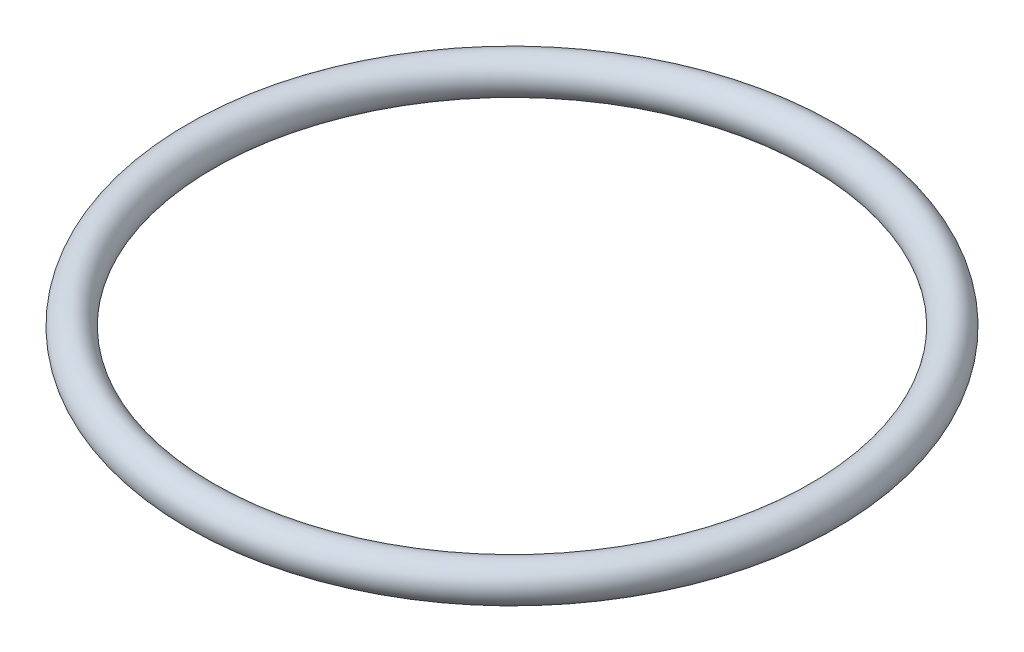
from build123d import *

# Parameters (mm, degrees)
ESQUISSE1_R = 0.875


with BuildPart() as part:
    # Esquisse1 → R_volution1 (revolve)
    with BuildSketch(Plane.XY, mode=Mode.PRIVATE) as r_volution1_sk:
        with Locations((15, 0)):
            Circle(ESQUISSE1_R)
    revolve(r_volution1_sk.sketch.rotate(Axis((0, 0, 0), (0, 1, 0)), 90), axis=Axis((0, 0, 0), (0, 1, 0)))


solid = part.part
